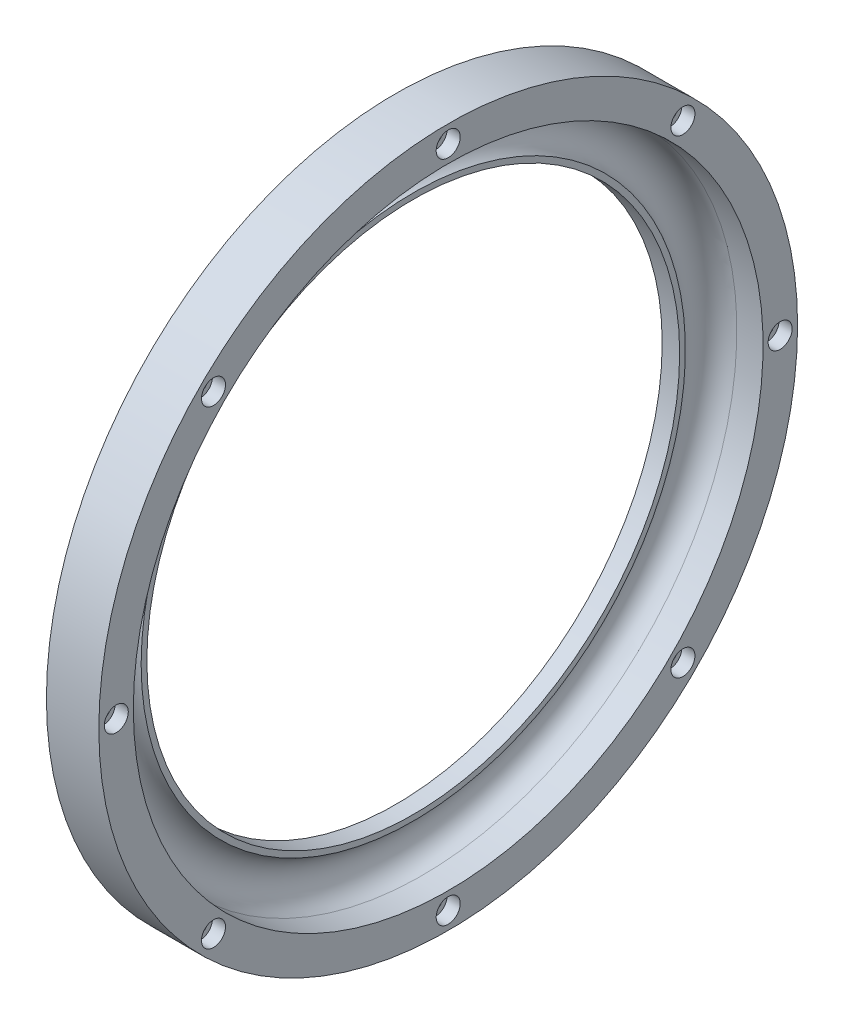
from build123d import *

# Parameters (mm, degrees)
ESQUISSE4_R             = 1.6
ENL_V_MAT_EXTRU_1_DEPTH = 12
ESQUISSE5_R             = 2.75
ENL_V_MAT_EXTRU_2_DEPTH = 3


with BuildPart() as part:
    # Esquisse3 → R_volution1 (revolve)
    with BuildSketch(Plane.XY, mode=Mode.PRIVATE) as r_volution1_sk:
        with BuildLine():
            Line((6, 72.1), (12, 72.1))
            Line((12, 72.1), (12, 80))
            Line((12, 80), (0, 80))
            Line((0, 80), (0, 61))
            Line((0, 61), (4, 61))
            Line((4, 61), (4, 62.308518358))
            ThreePointArc((4, 62.308518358), (1.003173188, 68.020647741), (6, 72.1))
        make_face()
    revolve(r_volution1_sk.sketch.rotate(Axis((-7.664449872, 0, 0), (1, 0, 0)), 90), axis=Axis((-7.664449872, 0, 0), (1, 0, 0)))

    # Esquisse4 → Enl_v. mat.-Extru.1 (cut)
    with BuildSketch(Plane(origin=(12, 0, 0), x_dir=(0, 0, -1), z_dir=(1, 0, 0))):
        with Locations((0, 76)):
            Circle(ESQUISSE4_R)
        with Locations((53.74011537, 53.74011537)):
            Circle(ESQUISSE4_R)
        with Locations((76, 0)):
            Circle(ESQUISSE4_R)
        with Locations((53.74011537, -53.74011537)):
            Circle(ESQUISSE4_R)
        with Locations((0, -76)):
            Circle(ESQUISSE4_R)
        with Locations((-53.74011537, -53.74011537)):
            Circle(ESQUISSE4_R)
        with Locations((-76, 0)):
            Circle(ESQUISSE4_R)
        with Locations((-53.74011537, 53.74011537)):
            Circle(ESQUISSE4_R)
    extrude(amount=-ENL_V_MAT_EXTRU_1_DEPTH, mode=Mode.SUBTRACT)

    # Esquisse5 → Enl_v. mat.-Extru.2 (cut)
    with BuildSketch(Plane(origin=(12, 0, 0), x_dir=(0, 0, -1), z_dir=(1, 0, 0))):
        with Locations((0, 76)):
            Circle(ESQUISSE5_R)
        with Locations((53.74011537, 53.74011537)):
            Circle(ESQUISSE5_R)
        with Locations((76, 0)):
            Circle(ESQUISSE5_R)
        with Locations((53.74011537, -53.74011537)):
            Circle(ESQUISSE5_R)
        with Locations((0, -76)):
            Circle(ESQUISSE5_R)
        with Locations((-53.74011537, -53.74011537)):
            Circle(ESQUISSE5_R)
        with Locations((-76, 0)):
            Circle(ESQUISSE5_R)
        with Locations((-53.74011537, 53.74011537)):
            Circle(ESQUISSE5_R)
    extrude(amount=-ENL_V_MAT_EXTRU_2_DEPTH, mode=Mode.SUBTRACT)


solid = part.part
